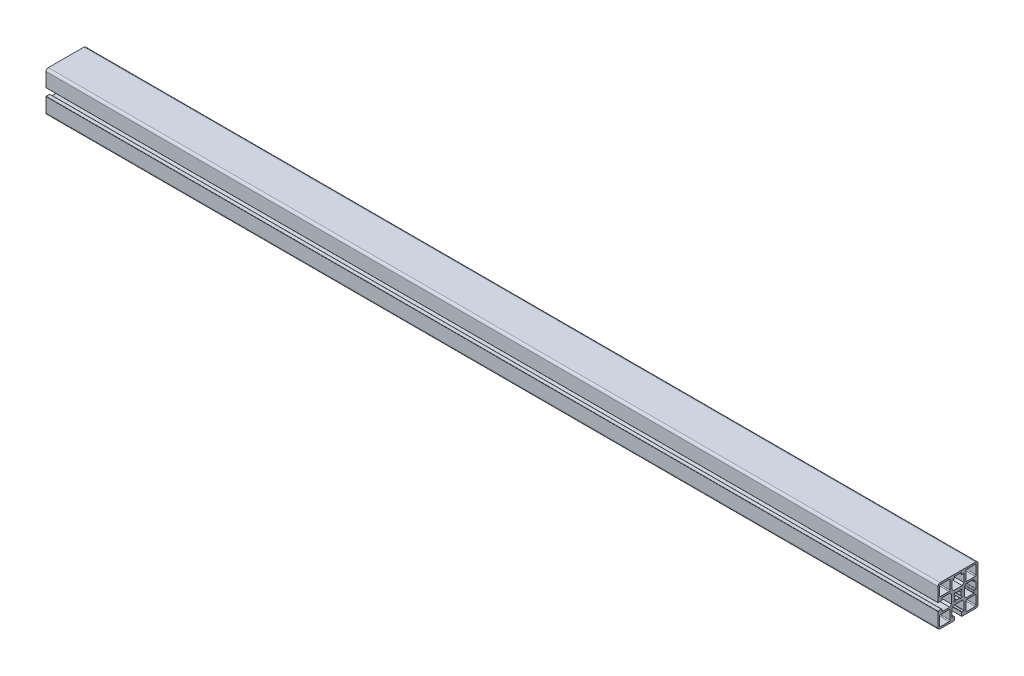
from build123d import *

# Parameters (mm, degrees)
F_45_SARJA_1_0175_45X45_L_2SS_VAHV_1_DEPTH = 1000


with BuildPart() as part:
    # Model → 45-sarja 1.0175 45X45 L 2SS VAHV_1 (new body)
    with BuildSketch(Plane(origin=(0, 0, 0), x_dir=(0, -1, 0), z_dir=(1, 0, 0))):
        with BuildLine():
            Line((-4.6, -18), (-6.5, -18))
            ThreePointArc((-6.5, -18), (-6.712132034, -17.912132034), (-6.8, -17.7))
            Line((-6.8, -17.7), (-6.8, -9.2))
            Line((-6.8, -9.2), (-4.8, -7.2))
            Line((-4.8, -7.2), (4.8, -7.2))
            Line((4.8, -7.2), (6.8, -9.2))
            Line((6.8, -9.2), (6.8, -17.7))
            ThreePointArc((6.8, -17.7), (6.712132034, -17.912132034), (6.5, -18))
            Line((6.5, -18), (4.6, -18))
            ThreePointArc((4.6, -18), (4.246446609, -18.146446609), (4.1, -18.5))
            Line((4.1, -18.5), (4.1, -22.2))
            ThreePointArc((4.1, -22.2), (4.187867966, -22.412132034), (4.4, -22.5))
            Line((4.4, -22.5), (20, -22.5))
            ThreePointArc((20, -22.5), (21.767766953, -21.767766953), (22.5, -20))
            Line((22.5, -20), (22.5, -4.4))
            ThreePointArc((22.5, -4.4), (22.412132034, -4.187867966), (22.2, -4.1))
            Line((22.2, -4.1), (18.5, -4.1))
            ThreePointArc((18.5, -4.1), (18.146446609, -4.246446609), (18, -4.6))
            Line((18, -4.6), (18, -6.5))
            ThreePointArc((18, -6.5), (17.912132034, -6.712132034), (17.7, -6.8))
            Line((17.7, -6.8), (9.2, -6.8))
            Line((9.2, -6.8), (7.2, -4.8))
            Line((7.2, -4.8), (7.2, 4.8))
            Line((7.2, 4.8), (9.2, 6.8))
            Line((9.2, 6.8), (17.7, 6.8))
            ThreePointArc((17.7, 6.8), (17.912132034, 6.712132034), (18, 6.5))
            Line((18, 6.5), (18, 4.6))
            ThreePointArc((18, 4.6), (18.146446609, 4.246446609), (18.5, 4.1))
            Line((18.5, 4.1), (22.2, 4.1))
            ThreePointArc((22.2, 4.1), (22.412132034, 4.187867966), (22.5, 4.4))
            Line((22.5, 4.4), (22.5, 20))
            ThreePointArc((22.5, 20), (21.767766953, 21.767766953), (20, 22.5))
            Line((20, 22.5), (-20, 22.5))
            ThreePointArc((-20, 22.5), (-21.767766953, 21.767766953), (-22.5, 20))
            Line((-22.5, 20), (-22.5, -20))
            ThreePointArc((-22.5, -20), (-21.767766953, -21.767766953), (-20, -22.5))
            Line((-20, -22.5), (-4.4, -22.5))
            ThreePointArc((-4.4, -22.5), (-4.187867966, -22.412132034), (-4.1, -22.2))
            Line((-4.1, -22.2), (-4.1, -18.5))
            ThreePointArc((-4.1, -18.5), (-4.246446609, -18.146446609), (-4.6, -18))
        make_face()
        with BuildLine():
            Line((6.5, 18), (4.6, 18))
            ThreePointArc((4.6, 18), (4.246446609, 18.146446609), (4.1, 18.5))
            Line((4.1, 18.5), (4.1, 20.2))
            ThreePointArc((4.1, 20.2), (4.012132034, 20.412132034), (3.8, 20.5))
            Line((3.8, 20.5), (-3.8, 20.5))
            ThreePointArc((-3.8, 20.5), (-4.012132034, 20.412132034), (-4.1, 20.2))
            Line((-4.1, 20.2), (-4.1, 18.5))
            ThreePointArc((-4.1, 18.5), (-4.246446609, 18.146446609), (-4.6, 18))
            Line((-4.6, 18), (-6.5, 18))
            ThreePointArc((-6.5, 18), (-6.712132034, 17.912132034), (-6.8, 17.7))
            Line((-6.8, 17.7), (-6.8, 9.2))
            Line((-6.8, 9.2), (-4.8, 7.2))
            Line((-4.8, 7.2), (4.8, 7.2))
            Line((4.8, 7.2), (6.8, 9.2))
            Line((6.8, 9.2), (6.8, 17.7))
            ThreePointArc((6.8, 17.7), (6.712132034, 17.912132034), (6.5, 18))
        make_face(mode=Mode.SUBTRACT)
        with BuildLine():
            Line((-9.8, 20.5), (-19.5, 20.5))
            ThreePointArc((-19.5, 20.5), (-20.207106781, 20.207106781), (-20.5, 19.5))
            Line((-20.5, 19.5), (-20.5, 9.8))
            ThreePointArc((-20.5, 9.8), (-20.207106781, 9.092893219), (-19.5, 8.8))
            Line((-19.5, 8.8), (-9.8, 8.8))
            ThreePointArc((-9.8, 8.8), (-9.092893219, 9.092893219), (-8.8, 9.8))
            Line((-8.8, 9.8), (-8.8, 19.5))
            ThreePointArc((-8.8, 19.5), (-9.092893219, 20.207106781), (-9.8, 20.5))
        make_face(mode=Mode.SUBTRACT)
        with BuildLine():
            Line((-20.5, -9.8), (-20.5, -19.5))
            ThreePointArc((-20.5, -19.5), (-20.207106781, -20.207106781), (-19.5, -20.5))
            Line((-19.5, -20.5), (-9.8, -20.5))
            ThreePointArc((-9.8, -20.5), (-9.092893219, -20.207106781), (-8.8, -19.5))
            Line((-8.8, -19.5), (-8.8, -9.8))
            ThreePointArc((-8.8, -9.8), (-9.092893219, -9.092893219), (-9.8, -8.8))
            Line((-9.8, -8.8), (-19.5, -8.8))
            ThreePointArc((-19.5, -8.8), (-20.207106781, -9.092893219), (-20.5, -9.8))
        make_face(mode=Mode.SUBTRACT)
        with BuildLine():
            Line((20.5, 9.8), (20.5, 19.5))
            ThreePointArc((20.5, 19.5), (20.207106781, 20.207106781), (19.5, 20.5))
            Line((19.5, 20.5), (9.8, 20.5))
            ThreePointArc((9.8, 20.5), (9.092893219, 20.207106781), (8.8, 19.5))
            Line((8.8, 19.5), (8.8, 9.8))
            ThreePointArc((8.8, 9.8), (9.092893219, 9.092893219), (9.8, 8.8))
            Line((9.8, 8.8), (19.5, 8.8))
            ThreePointArc((19.5, 8.8), (20.207106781, 9.092893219), (20.5, 9.8))
        make_face(mode=Mode.SUBTRACT)
        with BuildLine():
            Line((3.363290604, 1.949077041), (4.384062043, 2.969848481))
            ThreePointArc((4.384062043, 2.969848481), (4.471930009, 3.181980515), (4.384062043, 3.39411255))
            Line((4.384062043, 3.39411255), (3.39411255, 4.384062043))
            ThreePointArc((3.39411255, 4.384062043), (3.181980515, 4.471930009), (2.969848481, 4.384062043))
            Line((2.969848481, 4.384062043), (1.949077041, 3.363290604))
            ThreePointArc((1.949077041, 3.363290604), (1.786690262, 3.279575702), (1.605854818, 3.30557942))
            ThreePointArc((1.605854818, 3.30557942), (0, 3.675), (-1.605854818, 3.30557942))
            ThreePointArc((-1.605854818, 3.30557942), (-1.786690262, 3.279575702), (-1.949077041, 3.363290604))
            Line((-1.949077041, 3.363290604), (-2.969848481, 4.384062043))
            ThreePointArc((-2.969848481, 4.384062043), (-3.181980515, 4.471930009), (-3.39411255, 4.384062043))
            Line((-3.39411255, 4.384062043), (-4.384062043, 3.39411255))
            ThreePointArc((-4.384062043, 3.39411255), (-4.471930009, 3.181980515), (-4.384062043, 2.969848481))
            Line((-4.384062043, 2.969848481), (-3.363290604, 1.949077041))
            ThreePointArc((-3.363290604, 1.949077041), (-3.279575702, 1.786690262), (-3.30557942, 1.605854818))
            ThreePointArc((-3.30557942, 1.605854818), (-3.675, 0), (-3.30557942, -1.605854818))
            ThreePointArc((-3.30557942, -1.605854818), (-3.279575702, -1.786690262), (-3.363290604, -1.949077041))
            Line((-3.363290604, -1.949077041), (-4.384062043, -2.969848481))
            ThreePointArc((-4.384062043, -2.969848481), (-4.471930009, -3.181980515), (-4.384062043, -3.39411255))
            Line((-4.384062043, -3.39411255), (-3.39411255, -4.384062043))
            ThreePointArc((-3.39411255, -4.384062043), (-3.181980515, -4.471930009), (-2.969848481, -4.384062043))
            Line((-2.969848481, -4.384062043), (-1.949077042, -3.363290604))
            ThreePointArc((-1.949077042, -3.363290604), (-1.786690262, -3.279575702), (-1.605854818, -3.30557942))
            ThreePointArc((-1.605854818, -3.30557942), (0, -3.675), (1.605854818, -3.30557942))
            ThreePointArc((1.605854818, -3.30557942), (1.786690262, -3.279575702), (1.949077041, -3.363290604))
            Line((1.949077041, -3.363290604), (2.969848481, -4.384062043))
            ThreePointArc((2.969848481, -4.384062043), (3.181980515, -4.471930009), (3.39411255, -4.384062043))
            Line((3.39411255, -4.384062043), (4.384062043, -3.39411255))
            ThreePointArc((4.384062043, -3.39411255), (4.471930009, -3.181980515), (4.384062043, -2.969848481))
            Line((4.384062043, -2.969848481), (3.363290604, -1.949077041))
            ThreePointArc((3.363290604, -1.949077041), (3.279575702, -1.786690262), (3.30557942, -1.605854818))
            ThreePointArc((3.30557942, -1.605854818), (3.675, 0), (3.30557942, 1.605854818))
            ThreePointArc((3.30557942, 1.605854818), (3.279575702, 1.786690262), (3.363290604, 1.949077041))
        make_face(mode=Mode.SUBTRACT)
        with BuildLine():
            Line((19.5, -8.8), (9.8, -8.8))
            ThreePointArc((9.8, -8.8), (9.092893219, -9.092893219), (8.8, -9.8))
            Line((8.8, -9.8), (8.8, -19.5))
            ThreePointArc((8.8, -19.5), (9.092893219, -20.207106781), (9.8, -20.5))
            Line((9.8, -20.5), (19.5, -20.5))
            ThreePointArc((19.5, -20.5), (20.207106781, -20.207106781), (20.5, -19.5))
            Line((20.5, -19.5), (20.5, -9.8))
            ThreePointArc((20.5, -9.8), (20.207106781, -9.092893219), (19.5, -8.8))
        make_face(mode=Mode.SUBTRACT)
        with BuildLine():
            Line((-20.5, 3.8), (-20.5, -3.8))
            ThreePointArc((-20.5, -3.8), (-20.412132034, -4.012132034), (-20.2, -4.1))
            Line((-20.2, -4.1), (-18.5, -4.1))
            ThreePointArc((-18.5, -4.1), (-18.146446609, -4.246446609), (-18, -4.6))
            Line((-18, -4.6), (-18, -6.5))
            ThreePointArc((-18, -6.5), (-17.912132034, -6.712132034), (-17.7, -6.8))
            Line((-17.7, -6.8), (-9.2, -6.8))
            Line((-9.2, -6.8), (-7.2, -4.8))
            Line((-7.2, -4.8), (-7.2, 4.8))
            Line((-7.2, 4.8), (-9.2, 6.8))
            Line((-9.2, 6.8), (-17.7, 6.8))
            ThreePointArc((-17.7, 6.8), (-17.912132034, 6.712132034), (-18, 6.5))
            Line((-18, 6.5), (-18, 4.6))
            ThreePointArc((-18, 4.6), (-18.146446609, 4.246446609), (-18.5, 4.1))
            Line((-18.5, 4.1), (-20.2, 4.1))
            ThreePointArc((-20.2, 4.1), (-20.412132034, 4.012132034), (-20.5, 3.8))
        make_face(mode=Mode.SUBTRACT)
    extrude(amount=F_45_SARJA_1_0175_45X45_L_2SS_VAHV_1_DEPTH)


solid = part.part
